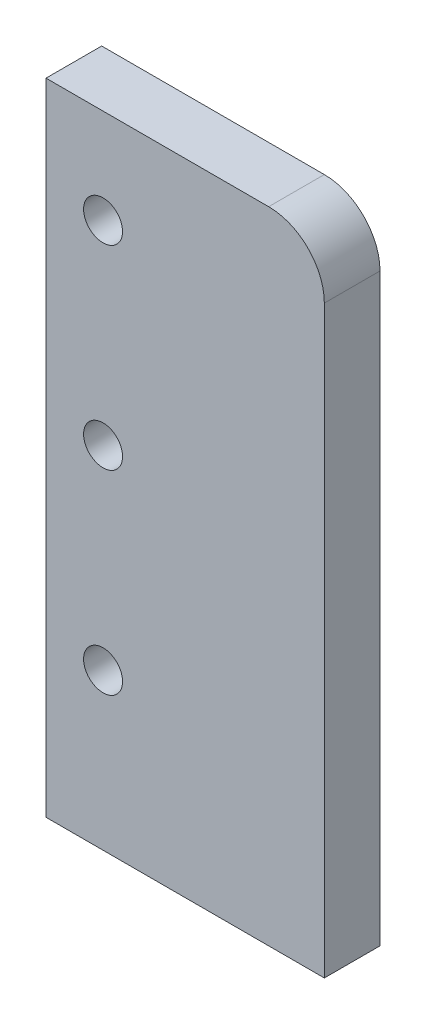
ISO-10303-21;
HEADER;
FILE_DESCRIPTION(('STEP AP214'),'2;1');
FILE_NAME('part.step','',(''),(''),'','','');
FILE_SCHEMA(('AUTOMOTIVE_DESIGN { 1 0 10303 214 1 1 1 1 }'));
ENDSEC;
DATA;
#1=APPLICATION_CONTEXT('core data for automotive mechanical design processes');
#2=APPLICATION_PROTOCOL_DEFINITION('international standard','automotive_design',2000,#1);
#3=PRODUCT_CONTEXT('',#1,'mechanical');
#4=PRODUCT('Part','Part','',(#3));
#5=PRODUCT_RELATED_PRODUCT_CATEGORY('part','',(#4));
#6=PRODUCT_DEFINITION_FORMATION('','',#4);
#7=PRODUCT_DEFINITION_CONTEXT('part definition',#1,'design');
#8=PRODUCT_DEFINITION('design','',#6,#7);
#9=PRODUCT_DEFINITION_SHAPE('','',#8);
#10=(LENGTH_UNIT() NAMED_UNIT(*) SI_UNIT(.MILLI.,.METRE.));
#11=(NAMED_UNIT(*) PLANE_ANGLE_UNIT() SI_UNIT($,.RADIAN.));
#12=(NAMED_UNIT(*) SI_UNIT($,.STERADIAN.) SOLID_ANGLE_UNIT());
#13=UNCERTAINTY_MEASURE_WITH_UNIT(LENGTH_MEASURE(1.E-05),#10,'distance_accuracy_value','');
#14=(GEOMETRIC_REPRESENTATION_CONTEXT(3) GLOBAL_UNCERTAINTY_ASSIGNED_CONTEXT((#13)) GLOBAL_UNIT_ASSIGNED_CONTEXT((#10,
#11,#12)) REPRESENTATION_CONTEXT('',''));
#15=CARTESIAN_POINT('',(0.,0.,0.));
#16=DIRECTION('',(0.,0.,1.));
#17=DIRECTION('',(1.,0.,0.));
#18=AXIS2_PLACEMENT_3D('',#15,#16,#17);
#19=CARTESIAN_POINT('',(0.,0.,20.));
#20=DIRECTION('',(1.,0.,0.));
#21=DIRECTION('',(0.,0.,-1.));
#22=AXIS2_PLACEMENT_3D('',#19,#20,#21);
#23=PLANE('',#22);
#24=DIRECTION('',(0.,-1.,0.));
#25=VECTOR('',#24,1.);
#26=CARTESIAN_POINT('',(0.,0.,0.));
#27=LINE('',#26,#25);
#28=CARTESIAN_POINT('',(0.,230.,0.));
#29=VERTEX_POINT('',#28);
#30=CARTESIAN_POINT('',(0.,0.,0.));
#31=VERTEX_POINT('',#30);
#32=EDGE_CURVE('E83',#29,#31,#27,.T.);
#33=ORIENTED_EDGE('',*,*,#32,.T.);
#34=DIRECTION('',(0.,0.,-1.));
#35=VECTOR('',#34,1.);
#36=CARTESIAN_POINT('',(0.,0.,20.));
#37=LINE('',#36,#35);
#38=CARTESIAN_POINT('',(0.,0.,20.));
#39=VERTEX_POINT('',#38);
#40=EDGE_CURVE('E11',#39,#31,#37,.T.);
#41=ORIENTED_EDGE('',*,*,#40,.F.);
#42=DIRECTION('',(0.,-1.,0.));
#43=VECTOR('',#42,1.);
#44=CARTESIAN_POINT('',(0.,0.,20.));
#45=LINE('',#44,#43);
#46=CARTESIAN_POINT('',(0.,230.,20.));
#47=VERTEX_POINT('',#46);
#48=EDGE_CURVE('E109',#47,#39,#45,.T.);
#49=ORIENTED_EDGE('',*,*,#48,.F.);
#50=DIRECTION('',(0.,0.,-1.));
#51=VECTOR('',#50,1.);
#52=CARTESIAN_POINT('',(0.,230.,20.));
#53=LINE('',#52,#51);
#54=EDGE_CURVE('E96',#47,#29,#53,.T.);
#55=ORIENTED_EDGE('',*,*,#54,.T.);
#56=EDGE_LOOP('',(#33,#41,#49,#55));
#57=FACE_BOUND('',#56,.T.);
#58=ADVANCED_FACE('F31',(#57),#23,.F.);
#59=CARTESIAN_POINT('',(0.,0.,20.));
#60=DIRECTION('',(0.,1.,0.));
#61=DIRECTION('',(0.,0.,1.));
#62=AXIS2_PLACEMENT_3D('',#59,#60,#61);
#63=PLANE('',#62);
#64=DIRECTION('',(1.,0.,0.));
#65=VECTOR('',#64,1.);
#66=CARTESIAN_POINT('',(0.,0.,0.));
#67=LINE('',#66,#65);
#68=CARTESIAN_POINT('',(100.,0.,0.));
#69=VERTEX_POINT('',#68);
#70=EDGE_CURVE('E79',#31,#69,#67,.T.);
#71=ORIENTED_EDGE('',*,*,#70,.T.);
#72=DIRECTION('',(0.,0.,-1.));
#73=VECTOR('',#72,1.);
#74=CARTESIAN_POINT('',(100.,0.,20.));
#75=LINE('',#74,#73);
#76=CARTESIAN_POINT('',(100.,0.,20.));
#77=VERTEX_POINT('',#76);
#78=EDGE_CURVE('E39',#77,#69,#75,.T.);
#79=ORIENTED_EDGE('',*,*,#78,.F.);
#80=DIRECTION('',(1.,0.,0.));
#81=VECTOR('',#80,1.);
#82=CARTESIAN_POINT('',(0.,0.,20.));
#83=LINE('',#82,#81);
#84=EDGE_CURVE('E92',#39,#77,#83,.T.);
#85=ORIENTED_EDGE('',*,*,#84,.F.);
#86=ORIENTED_EDGE('',*,*,#40,.T.);
#87=EDGE_LOOP('',(#71,#79,#85,#86));
#88=FACE_BOUND('',#87,.T.);
#89=ADVANCED_FACE('F91',(#88),#63,.F.);
#90=CARTESIAN_POINT('',(100.,0.,20.));
#91=DIRECTION('',(-1.,0.,0.));
#92=DIRECTION('',(0.,0.,1.));
#93=AXIS2_PLACEMENT_3D('',#90,#91,#92);
#94=PLANE('',#93);
#95=DIRECTION('',(0.,1.,0.));
#96=VECTOR('',#95,1.);
#97=CARTESIAN_POINT('',(100.,0.,0.));
#98=LINE('',#97,#96);
#99=CARTESIAN_POINT('',(100.,210.,0.));
#100=VERTEX_POINT('',#99);
#101=EDGE_CURVE('E85',#69,#100,#98,.T.);
#102=ORIENTED_EDGE('',*,*,#101,.T.);
#103=DIRECTION('',(0.,0.,-1.));
#104=VECTOR('',#103,1.);
#105=CARTESIAN_POINT('',(100.,210.,20.));
#106=LINE('',#105,#104);
#107=CARTESIAN_POINT('',(100.,210.,20.));
#108=VERTEX_POINT('',#107);
#109=EDGE_CURVE('E120',#108,#100,#106,.T.);
#110=ORIENTED_EDGE('',*,*,#109,.F.);
#111=DIRECTION('',(0.,1.,0.));
#112=VECTOR('',#111,1.);
#113=CARTESIAN_POINT('',(100.,0.,20.));
#114=LINE('',#113,#112);
#115=EDGE_CURVE('E112',#77,#108,#114,.T.);
#116=ORIENTED_EDGE('',*,*,#115,.F.);
#117=ORIENTED_EDGE('',*,*,#78,.T.);
#118=EDGE_LOOP('',(#102,#110,#116,#117));
#119=FACE_BOUND('',#118,.T.);
#120=ADVANCED_FACE('F125',(#119),#94,.F.);
#121=CARTESIAN_POINT('',(80.,210.,20.));
#122=DIRECTION('',(0.,0.,-1.));
#123=DIRECTION('',(-1.,0.,0.));
#124=AXIS2_PLACEMENT_3D('',#121,#122,#123);
#125=CYLINDRICAL_SURFACE('',#124,20.);
#126=CARTESIAN_POINT('',(80.,210.,0.));
#127=DIRECTION('',(0.,0.,1.));
#128=DIRECTION('',(1.,0.,0.));
#129=AXIS2_PLACEMENT_3D('',#126,#127,#128);
#130=CIRCLE('',#129,20.);
#131=CARTESIAN_POINT('',(80.,230.,0.));
#132=VERTEX_POINT('',#131);
#133=EDGE_CURVE('E105',#100,#132,#130,.T.);
#134=ORIENTED_EDGE('',*,*,#133,.T.);
#135=DIRECTION('',(0.,0.,-1.));
#136=VECTOR('',#135,1.);
#137=CARTESIAN_POINT('',(80.,230.,20.));
#138=LINE('',#137,#136);
#139=CARTESIAN_POINT('',(80.,230.,20.));
#140=VERTEX_POINT('',#139);
#141=EDGE_CURVE('E117',#140,#132,#138,.T.);
#142=ORIENTED_EDGE('',*,*,#141,.F.);
#143=CARTESIAN_POINT('',(80.,210.,20.));
#144=DIRECTION('',(0.,0.,1.));
#145=DIRECTION('',(1.,0.,0.));
#146=AXIS2_PLACEMENT_3D('',#143,#144,#145);
#147=CIRCLE('',#146,20.);
#148=EDGE_CURVE('E52',#108,#140,#147,.T.);
#149=ORIENTED_EDGE('',*,*,#148,.F.);
#150=ORIENTED_EDGE('',*,*,#109,.T.);
#151=EDGE_LOOP('',(#134,#142,#149,#150));
#152=FACE_BOUND('',#151,.T.);
#153=ADVANCED_FACE('F139',(#152),#125,.T.);
#154=CARTESIAN_POINT('',(0.,230.,20.));
#155=DIRECTION('',(0.,-1.,0.));
#156=DIRECTION('',(1.,0.,0.));
#157=AXIS2_PLACEMENT_3D('',#154,#155,#156);
#158=PLANE('',#157);
#159=DIRECTION('',(-1.,0.,0.));
#160=VECTOR('',#159,1.);
#161=CARTESIAN_POINT('',(0.,230.,0.));
#162=LINE('',#161,#160);
#163=EDGE_CURVE('E107',#132,#29,#162,.T.);
#164=ORIENTED_EDGE('',*,*,#163,.T.);
#165=ORIENTED_EDGE('',*,*,#54,.F.);
#166=DIRECTION('',(-1.,0.,0.));
#167=VECTOR('',#166,1.);
#168=CARTESIAN_POINT('',(0.,230.,20.));
#169=LINE('',#168,#167);
#170=EDGE_CURVE('E47',#140,#47,#169,.T.);
#171=ORIENTED_EDGE('',*,*,#170,.F.);
#172=ORIENTED_EDGE('',*,*,#141,.T.);
#173=EDGE_LOOP('',(#164,#165,#171,#172));
#174=FACE_BOUND('',#173,.T.);
#175=ADVANCED_FACE('F129',(#174),#158,.F.);
#176=CARTESIAN_POINT('',(80.,210.,20.));
#177=DIRECTION('',(0.,0.,1.));
#178=DIRECTION('',(1.,0.,0.));
#179=AXIS2_PLACEMENT_3D('',#176,#177,#178);
#180=PLANE('',#179);
#181=CARTESIAN_POINT('',(20.5,56.,20.));
#182=DIRECTION('',(0.,0.,1.));
#183=DIRECTION('',(1.,0.,0.));
#184=AXIS2_PLACEMENT_3D('',#181,#182,#183);
#185=CIRCLE('',#184,6.99999999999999);
#186=CARTESIAN_POINT('',(27.5,56.,20.));
#187=VERTEX_POINT('',#186);
#188=EDGE_CURVE('E208',#187,#187,#185,.T.);
#189=ORIENTED_EDGE('',*,*,#188,.F.);
#190=EDGE_LOOP('',(#189));
#191=FACE_BOUND('',#190,.T.);
#192=CARTESIAN_POINT('',(20.5,126.,20.));
#193=DIRECTION('',(0.,0.,1.));
#194=DIRECTION('',(1.,0.,0.));
#195=AXIS2_PLACEMENT_3D('',#192,#193,#194);
#196=CIRCLE('',#195,6.99999999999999);
#197=CARTESIAN_POINT('',(27.5,126.,20.));
#198=VERTEX_POINT('',#197);
#199=EDGE_CURVE('E212',#198,#198,#196,.T.);
#200=ORIENTED_EDGE('',*,*,#199,.F.);
#201=EDGE_LOOP('',(#200));
#202=FACE_BOUND('',#201,.T.);
#203=CARTESIAN_POINT('',(20.5,196.,20.));
#204=DIRECTION('',(0.,0.,1.));
#205=DIRECTION('',(1.,0.,0.));
#206=AXIS2_PLACEMENT_3D('',#203,#204,#205);
#207=CIRCLE('',#206,6.99999999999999);
#208=CARTESIAN_POINT('',(27.5,196.,20.));
#209=VERTEX_POINT('',#208);
#210=EDGE_CURVE('E100',#209,#209,#207,.T.);
#211=ORIENTED_EDGE('',*,*,#210,.F.);
#212=EDGE_LOOP('',(#211));
#213=FACE_BOUND('',#212,.T.);
#214=ORIENTED_EDGE('',*,*,#48,.T.);
#215=ORIENTED_EDGE('',*,*,#84,.T.);
#216=ORIENTED_EDGE('',*,*,#115,.T.);
#217=ORIENTED_EDGE('',*,*,#148,.T.);
#218=ORIENTED_EDGE('',*,*,#170,.T.);
#219=EDGE_LOOP('',(#214,#215,#216,#217,#218));
#220=FACE_BOUND('',#219,.T.);
#221=ADVANCED_FACE('F127',(#191,#202,#213,#220),#180,.T.);
#222=CARTESIAN_POINT('',(80.,210.,0.));
#223=DIRECTION('',(0.,0.,1.));
#224=DIRECTION('',(1.,0.,0.));
#225=AXIS2_PLACEMENT_3D('',#222,#223,#224);
#226=PLANE('',#225);
#227=CARTESIAN_POINT('',(20.5,56.,0.));
#228=DIRECTION('',(0.,0.,1.));
#229=DIRECTION('',(1.,0.,0.));
#230=AXIS2_PLACEMENT_3D('',#227,#228,#229);
#231=CIRCLE('',#230,6.99999999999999);
#232=CARTESIAN_POINT('',(27.5,56.,0.));
#233=VERTEX_POINT('',#232);
#234=EDGE_CURVE('E211',#233,#233,#231,.T.);
#235=ORIENTED_EDGE('',*,*,#234,.T.);
#236=EDGE_LOOP('',(#235));
#237=FACE_BOUND('',#236,.T.);
#238=CARTESIAN_POINT('',(20.5,126.,0.));
#239=DIRECTION('',(0.,0.,1.));
#240=DIRECTION('',(1.,0.,0.));
#241=AXIS2_PLACEMENT_3D('',#238,#239,#240);
#242=CIRCLE('',#241,6.99999999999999);
#243=CARTESIAN_POINT('',(27.5,126.,0.));
#244=VERTEX_POINT('',#243);
#245=EDGE_CURVE('E34',#244,#244,#242,.T.);
#246=ORIENTED_EDGE('',*,*,#245,.T.);
#247=EDGE_LOOP('',(#246));
#248=FACE_BOUND('',#247,.T.);
#249=CARTESIAN_POINT('',(20.5,196.,0.));
#250=DIRECTION('',(0.,0.,1.));
#251=DIRECTION('',(1.,0.,0.));
#252=AXIS2_PLACEMENT_3D('',#249,#250,#251);
#253=CIRCLE('',#252,6.99999999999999);
#254=CARTESIAN_POINT('',(27.5,196.,0.));
#255=VERTEX_POINT('',#254);
#256=EDGE_CURVE('E97',#255,#255,#253,.T.);
#257=ORIENTED_EDGE('',*,*,#256,.T.);
#258=EDGE_LOOP('',(#257));
#259=FACE_BOUND('',#258,.T.);
#260=ORIENTED_EDGE('',*,*,#32,.F.);
#261=ORIENTED_EDGE('',*,*,#163,.F.);
#262=ORIENTED_EDGE('',*,*,#133,.F.);
#263=ORIENTED_EDGE('',*,*,#101,.F.);
#264=ORIENTED_EDGE('',*,*,#70,.F.);
#265=EDGE_LOOP('',(#260,#261,#262,#263,#264));
#266=FACE_BOUND('',#265,.T.);
#267=ADVANCED_FACE('F80',(#237,#248,#259,#266),#226,.F.);
#268=CARTESIAN_POINT('',(20.5,196.,20.));
#269=DIRECTION('',(0.,0.,1.));
#270=DIRECTION('',(1.,0.,0.));
#271=AXIS2_PLACEMENT_3D('',#268,#269,#270);
#272=CYLINDRICAL_SURFACE('',#271,6.99999999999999);
#273=ORIENTED_EDGE('',*,*,#210,.T.);
#274=EDGE_LOOP('',(#273));
#275=FACE_BOUND('',#274,.T.);
#276=ORIENTED_EDGE('',*,*,#256,.F.);
#277=EDGE_LOOP('',(#276));
#278=FACE_BOUND('',#277,.T.);
#279=ADVANCED_FACE('F136',(#275,#278),#272,.F.);
#280=CARTESIAN_POINT('',(20.5,126.,20.));
#281=DIRECTION('',(0.,0.,1.));
#282=DIRECTION('',(1.,0.,0.));
#283=AXIS2_PLACEMENT_3D('',#280,#281,#282);
#284=CYLINDRICAL_SURFACE('',#283,6.99999999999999);
#285=ORIENTED_EDGE('',*,*,#199,.T.);
#286=EDGE_LOOP('',(#285));
#287=FACE_BOUND('',#286,.T.);
#288=ORIENTED_EDGE('',*,*,#245,.F.);
#289=EDGE_LOOP('',(#288));
#290=FACE_BOUND('',#289,.T.);
#291=ADVANCED_FACE('F182',(#287,#290),#284,.F.);
#292=CARTESIAN_POINT('',(20.5,56.,20.));
#293=DIRECTION('',(0.,0.,1.));
#294=DIRECTION('',(1.,0.,0.));
#295=AXIS2_PLACEMENT_3D('',#292,#293,#294);
#296=CYLINDRICAL_SURFACE('',#295,6.99999999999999);
#297=ORIENTED_EDGE('',*,*,#188,.T.);
#298=EDGE_LOOP('',(#297));
#299=FACE_BOUND('',#298,.T.);
#300=ORIENTED_EDGE('',*,*,#234,.F.);
#301=EDGE_LOOP('',(#300));
#302=FACE_BOUND('',#301,.T.);
#303=ADVANCED_FACE('F192',(#299,#302),#296,.F.);
#304=CLOSED_SHELL('',(#58,#89,#120,#153,#175,#221,#267,#279,#291,#303));
#305=MANIFOLD_SOLID_BREP('B2',#304);
#306=ADVANCED_BREP_SHAPE_REPRESENTATION('',(#18,#305),#14);
#307=SHAPE_DEFINITION_REPRESENTATION(#9,#306);
ENDSEC;
END-ISO-10303-21;
